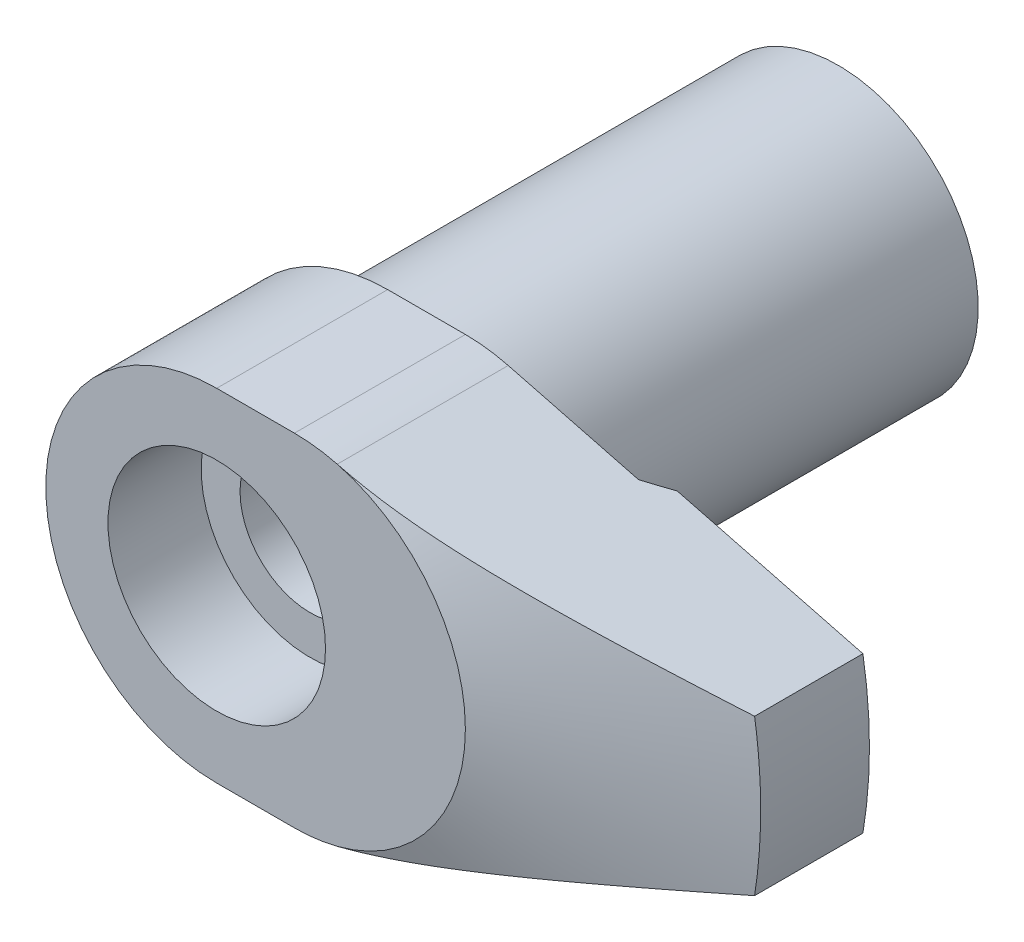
ISO-10303-21;
HEADER;
FILE_DESCRIPTION(('STEP AP214'),'2;1');
FILE_NAME('part.step','',(''),(''),'','','');
FILE_SCHEMA(('AUTOMOTIVE_DESIGN { 1 0 10303 214 1 1 1 1 }'));
ENDSEC;
DATA;
#1=APPLICATION_CONTEXT('core data for automotive mechanical design processes');
#2=APPLICATION_PROTOCOL_DEFINITION('international standard','automotive_design',2000,#1);
#3=PRODUCT_CONTEXT('',#1,'mechanical');
#4=PRODUCT('Part','Part','',(#3));
#5=PRODUCT_RELATED_PRODUCT_CATEGORY('part','',(#4));
#6=PRODUCT_DEFINITION_FORMATION('','',#4);
#7=PRODUCT_DEFINITION_CONTEXT('part definition',#1,'design');
#8=PRODUCT_DEFINITION('design','',#6,#7);
#9=PRODUCT_DEFINITION_SHAPE('','',#8);
#10=(LENGTH_UNIT() NAMED_UNIT(*) SI_UNIT(.MILLI.,.METRE.));
#11=(NAMED_UNIT(*) PLANE_ANGLE_UNIT() SI_UNIT($,.RADIAN.));
#12=(NAMED_UNIT(*) SI_UNIT($,.STERADIAN.) SOLID_ANGLE_UNIT());
#13=UNCERTAINTY_MEASURE_WITH_UNIT(LENGTH_MEASURE(1.E-05),#10,'distance_accuracy_value','');
#14=(GEOMETRIC_REPRESENTATION_CONTEXT(3) GLOBAL_UNCERTAINTY_ASSIGNED_CONTEXT((#13)) GLOBAL_UNIT_ASSIGNED_CONTEXT((#10,
#11,#12)) REPRESENTATION_CONTEXT('',''));
#15=CARTESIAN_POINT('',(0.,0.,0.));
#16=DIRECTION('',(0.,0.,1.));
#17=DIRECTION('',(1.,0.,0.));
#18=AXIS2_PLACEMENT_3D('',#15,#16,#17);
#19=CARTESIAN_POINT('',(29.5803989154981,-5.,28.));
#20=DIRECTION('',(0.250587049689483,-0.968094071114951,0.));
#21=DIRECTION('',(0.968094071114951,0.250587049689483,0.));
#22=AXIS2_PLACEMENT_3D('',#19,#20,#21);
#23=PLANE('',#22);
#24=DIRECTION('',(0.,0.,1.));
#25=VECTOR('',#24,1.);
#26=CARTESIAN_POINT('',(29.5803989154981,-5.,28.));
#27=LINE('',#26,#25);
#28=CARTESIAN_POINT('',(29.5803989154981,-5.,28.));
#29=VERTEX_POINT('',#28);
#30=CARTESIAN_POINT('',(29.5803989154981,-5.,34.9700786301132));
#31=VERTEX_POINT('',#30);
#32=EDGE_CURVE('E141',#29,#31,#27,.T.);
#33=ORIENTED_EDGE('',*,*,#32,.T.);
#34=CARTESIAN_POINT('',(29.5805989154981,-4.99994823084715,34.9700123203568));
#35=CARTESIAN_POINT('',(29.1357626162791,-5.11509222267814,35.1174860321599));
#36=CARTESIAN_POINT('',(28.6906869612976,-5.23029817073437,35.2641938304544));
#37=CARTESIAN_POINT('',(27.7999660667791,-5.46085750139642,35.5557686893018));
#38=CARTESIAN_POINT('',(27.3543208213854,-5.57621088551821,35.7006357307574));
#39=CARTESIAN_POINT('',(26.4624675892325,-5.80706331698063,35.9881885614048));
#40=CARTESIAN_POINT('',(26.0162597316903,-5.92256233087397,36.1308747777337));
#41=CARTESIAN_POINT('',(25.1230866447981,-6.15375640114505,36.4136944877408));
#42=CARTESIAN_POINT('',(24.6761214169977,-6.26945145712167,36.5538279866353));
#43=CARTESIAN_POINT('',(23.7834718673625,-6.50051001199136,36.8303799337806));
#44=CARTESIAN_POINT('',(23.3377918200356,-6.61587240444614,36.9668130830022));
#45=CARTESIAN_POINT('',(22.4454084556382,-6.84686205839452,37.2360589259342));
#46=CARTESIAN_POINT('',(21.9987051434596,-6.96248931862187,37.3688716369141));
#47=CARTESIAN_POINT('',(21.103931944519,-7.19409757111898,37.6301684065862));
#48=CARTESIAN_POINT('',(20.6558616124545,-7.31007867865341,37.7586508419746));
#49=CARTESIAN_POINT('',(19.7583140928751,-7.54240505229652,38.0102832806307));
#50=CARTESIAN_POINT('',(19.3088369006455,-7.65875031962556,38.1334332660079));
#51=CARTESIAN_POINT('',(18.4054157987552,-7.89259704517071,38.3739579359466));
#52=CARTESIAN_POINT('',(17.9514615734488,-8.01010117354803,38.4912914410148));
#53=CARTESIAN_POINT('',(17.0416464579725,-8.24560296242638,38.7178219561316));
#54=CARTESIAN_POINT('',(16.5857855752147,-8.36360062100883,38.8270189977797));
#55=CARTESIAN_POINT('',(15.672322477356,-8.60004667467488,39.0352992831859));
#56=CARTESIAN_POINT('',(15.2147222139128,-8.71849456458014,39.1343915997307));
#57=CARTESIAN_POINT('',(14.297156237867,-8.95600263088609,39.3203168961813));
#58=CARTESIAN_POINT('',(13.8371904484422,-9.07506282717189,39.4071494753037));
#59=CARTESIAN_POINT('',(12.9125012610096,-9.31441470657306,39.5663560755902));
#60=CARTESIAN_POINT('',(12.4477655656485,-9.43470957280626,39.638654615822));
#61=CARTESIAN_POINT('',(11.5160403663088,-9.6758826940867,39.7654169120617));
#62=CARTESIAN_POINT('',(11.0490512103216,-9.79676085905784,39.8198833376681));
#63=CARTESIAN_POINT('',(10.3464754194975,-9.97861962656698,39.8863416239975));
#64=CARTESIAN_POINT('',(10.111552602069,-10.0394284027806,39.9059735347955));
#65=CARTESIAN_POINT('',(9.64134067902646,-10.1611407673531,39.939841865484));
#66=CARTESIAN_POINT('',(9.40605157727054,-10.2220443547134,39.9540783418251));
#67=CARTESIAN_POINT('',(8.93508346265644,-10.3439524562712,39.9769487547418));
#68=CARTESIAN_POINT('',(8.69940430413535,-10.4049570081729,39.9855794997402));
#69=CARTESIAN_POINT('',(8.22790353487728,-10.5270029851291,39.9971137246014));
#70=CARTESIAN_POINT('',(7.99208191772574,-10.5880444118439,40.0000169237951));
#71=CARTESIAN_POINT('',(7.75625754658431,-10.6490865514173,39.9999999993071));
#72=B_SPLINE_CURVE_WITH_KNOTS('',3,(#34,#35,#36,#37,#38,#39,#40,#41,#42,#43,#44,#45,#46,#47,#48,
#49,#50,#51,#52,#53,#54,#55,#56,#57,#58,#59,#60,#61,#62,#63,#64,#65,#66,#67,#68,#69,#70,#71),
.UNSPECIFIED.,.F.,.F.,(4,2,2,2,2,2,2,2,2,2,2,2,2,2,2,2,2,2,4),(0.,1.44774916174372,
2.89551333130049,4.34299021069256,5.79046413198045,7.23093053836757,8.67139007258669,
10.1123837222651,11.5533822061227,13.0034407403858,14.4534936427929,15.9022328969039,
17.3510195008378,18.8071461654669,20.2630547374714,20.9933787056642,21.7236950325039,
22.4544267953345,23.1851943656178),.UNSPECIFIED.);
#73=CARTESIAN_POINT('',(7.75645754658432,-10.6490347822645,40.));
#74=VERTEX_POINT('',#73);
#75=EDGE_CURVE('E36',#31,#74,#72,.T.);
#76=ORIENTED_EDGE('',*,*,#75,.T.);
#77=DIRECTION('',(0.,0.,1.));
#78=VECTOR('',#77,1.);
#79=CARTESIAN_POINT('',(7.75645754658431,-10.6490347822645,28.));
#80=LINE('',#79,#78);
#81=CARTESIAN_POINT('',(7.75645754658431,-10.6490347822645,29.));
#82=VERTEX_POINT('',#81);
#83=EDGE_CURVE('E145',#82,#74,#80,.T.);
#84=ORIENTED_EDGE('',*,*,#83,.F.);
#85=DIRECTION('',(-0.968094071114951,-0.250587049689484,0.));
#86=VECTOR('',#85,1.);
#87=CARTESIAN_POINT('',(16.1403981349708,-8.47888727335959,29.));
#88=LINE('',#87,#86);
#89=CARTESIAN_POINT('',(16.1403981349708,-8.47888727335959,29.));
#90=VERTEX_POINT('',#89);
#91=EDGE_CURVE('E219',#90,#82,#88,.T.);
#92=ORIENTED_EDGE('',*,*,#91,.F.);
#93=CARTESIAN_POINT('',(-0.356308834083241,-12.7489899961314,29.171522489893));
#94=CARTESIAN_POINT('',(-0.159761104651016,-12.6981144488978,29.2945403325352));
#95=CARTESIAN_POINT('',(0.0379983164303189,-12.6469252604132,29.4155205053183));
#96=CARTESIAN_POINT('',(0.436199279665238,-12.5438526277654,29.6527843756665));
#97=CARTESIAN_POINT('',(0.636641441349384,-12.4919690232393,29.7690669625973));
#98=CARTESIAN_POINT('',(1.04115426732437,-12.3872625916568,29.9966949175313));
#99=CARTESIAN_POINT('',(1.24523595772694,-12.3344369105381,30.1080194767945));
#100=CARTESIAN_POINT('',(1.65644867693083,-12.2279962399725,30.3244385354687));
#101=CARTESIAN_POINT('',(1.86357952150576,-12.1743812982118,30.4295334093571));
#102=CARTESIAN_POINT('',(2.49827963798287,-12.010091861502,30.7382708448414));
#103=CARTESIAN_POINT('',(2.93106166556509,-11.8980680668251,30.9307264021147));
#104=CARTESIAN_POINT('',(3.81057680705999,-11.6704092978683,31.2766267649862));
#105=CARTESIAN_POINT('',(4.25728771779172,-11.5547800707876,31.4301304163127));
#106=CARTESIAN_POINT('',(5.02089611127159,-11.3571232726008,31.6470390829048));
#107=CARTESIAN_POINT('',(5.33428496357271,-11.2760038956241,31.7235904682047));
#108=CARTESIAN_POINT('',(5.96612529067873,-11.1124547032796,31.8502162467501));
#109=CARTESIAN_POINT('',(6.28457678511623,-11.03002488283,31.9002905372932));
#110=CARTESIAN_POINT('',(6.92169076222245,-10.8651106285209,31.9710605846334));
#111=CARTESIAN_POINT('',(7.24032600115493,-10.7826332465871,31.9920145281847));
#112=CARTESIAN_POINT('',(7.87812931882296,-10.6175405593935,32.0042125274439));
#113=CARTESIAN_POINT('',(8.1972973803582,-10.5349252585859,31.9954575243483));
#114=CARTESIAN_POINT('',(8.83369537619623,-10.3701963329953,31.9487276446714));
#115=CARTESIAN_POINT('',(9.15092463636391,-10.2880828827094,31.9107431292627));
#116=CARTESIAN_POINT('',(9.78117559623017,-10.1249450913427,31.8075575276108));
#117=CARTESIAN_POINT('',(10.0941968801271,-10.0439208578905,31.7423537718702));
#118=CARTESIAN_POINT('',(10.7160969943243,-9.88294464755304,31.5873480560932));
#119=CARTESIAN_POINT('',(11.0249465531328,-9.8030002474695,31.4974223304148));
#120=CARTESIAN_POINT('',(11.6360813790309,-9.64481058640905,31.2965660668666));
#121=CARTESIAN_POINT('',(11.9383669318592,-9.56656525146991,31.185636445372));
#122=CARTESIAN_POINT('',(12.6350607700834,-9.38622900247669,30.9065344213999));
#123=CARTESIAN_POINT('',(13.026903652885,-9.28480213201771,30.7315591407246));
#124=CARTESIAN_POINT('',(13.7995718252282,-9.08480024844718,30.3571468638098));
#125=CARTESIAN_POINT('',(14.1803909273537,-8.98622683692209,30.1576964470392));
#126=CARTESIAN_POINT('',(14.9328451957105,-8.7914572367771,29.739394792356));
#127=CARTESIAN_POINT('',(15.3044597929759,-8.69526637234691,29.520504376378));
#128=CARTESIAN_POINT('',(16.0389739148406,-8.50514050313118,29.0678893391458));
#129=CARTESIAN_POINT('',(16.4018749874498,-8.4112050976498,28.8341673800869));
#130=CARTESIAN_POINT('',(17.1231554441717,-8.22450470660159,28.3530942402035));
#131=CARTESIAN_POINT('',(17.4814762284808,-8.13175488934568,28.1056497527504));
#132=CARTESIAN_POINT('',(18.1917862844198,-7.9478941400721,27.6012566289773));
#133=CARTESIAN_POINT('',(18.5437753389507,-7.85678326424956,27.344307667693));
#134=CARTESIAN_POINT('',(19.241984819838,-7.67605469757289,26.8230436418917));
#135=CARTESIAN_POINT('',(19.5882113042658,-7.58643543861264,26.5587372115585));
#136=CARTESIAN_POINT('',(20.2760952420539,-7.40837959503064,26.0238828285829));
#137=CARTESIAN_POINT('',(20.6177527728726,-7.31994299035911,25.7533349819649));
#138=CARTESIAN_POINT('',(21.5179640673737,-7.08692710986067,25.0296038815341));
#139=CARTESIAN_POINT('',(22.0731795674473,-6.94321192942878,24.5719921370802));
#140=CARTESIAN_POINT('',(23.1755337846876,-6.65787220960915,23.646249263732));
#141=CARTESIAN_POINT('',(23.7226703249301,-6.51624823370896,23.1781153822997));
#142=CARTESIAN_POINT('',(24.8002386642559,-6.23732423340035,22.2427262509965));
#143=CARTESIAN_POINT('',(25.3307912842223,-6.09999293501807,21.7756192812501));
#144=CARTESIAN_POINT('',(26.1227350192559,-5.89500165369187,21.0705230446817));
#145=CARTESIAN_POINT('',(26.3860198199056,-5.82685149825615,20.8347962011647));
#146=CARTESIAN_POINT('',(26.9114454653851,-5.69084729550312,20.3619909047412));
#147=CARTESIAN_POINT('',(27.1735863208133,-5.62299324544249,20.124912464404));
#148=CARTESIAN_POINT('',(27.4352162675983,-5.55527144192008,19.8872336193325));
#149=B_SPLINE_CURVE_WITH_KNOTS('',3,(#93,#94,#95,#96,#97,#98,#99,#100,#101,#102,#103,#104,#105,
#106,#107,#108,#109,#110,#111,#112,#113,#114,#115,#116,#117,#118,#119,#120,#121,#122,#123,#124,
#125,#126,#127,#128,#129,#130,#131,#132,#133,#134,#135,#136,#137,#138,#139,#140,#141,#142,#143,
#144,#145,#146,#147,#148),.UNSPECIFIED.,.F.,.F.,(4,2,2,2,2,2,2,2,2,2,2,2,2,2,2,2,2,2,2,2,2,2,2,
2,2,2,2,4),(0.,0.712170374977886,1.42450815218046,2.13959781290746,2.85464444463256,
4.31337521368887,5.76988893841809,6.76688167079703,7.76387827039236,8.75197765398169,
9.74004573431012,10.7284397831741,11.7169307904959,12.710463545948,13.7039529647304,
15.0257282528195,16.3482315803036,17.6734634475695,18.9984581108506,20.3339498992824,
21.6694873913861,23.0035186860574,24.3375273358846,26.5384684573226,28.7399921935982,
30.9002141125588,31.9799210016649,33.0596178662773),.UNSPECIFIED.);
#150=CARTESIAN_POINT('',(17.6291186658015,-8.09353826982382,28.));
#151=VERTEX_POINT('',#150);
#152=EDGE_CURVE('E196',#90,#151,#149,.T.);
#153=ORIENTED_EDGE('',*,*,#152,.T.);
#154=DIRECTION('',(0.968094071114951,0.250587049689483,0.));
#155=VECTOR('',#154,1.);
#156=CARTESIAN_POINT('',(29.5803989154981,-5.,28.));
#157=LINE('',#156,#155);
#158=EDGE_CURVE('E135',#151,#29,#157,.T.);
#159=ORIENTED_EDGE('',*,*,#158,.T.);
#160=EDGE_LOOP('',(#33,#76,#84,#92,#153,#159));
#161=FACE_BOUND('',#160,.T.);
#162=ADVANCED_FACE('F15',(#161),#23,.T.);
#163=CARTESIAN_POINT('',(29.5803989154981,5.,28.));
#164=DIRECTION('',(0.250587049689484,0.968094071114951,0.));
#165=DIRECTION('',(-0.968094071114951,0.250587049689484,0.));
#166=AXIS2_PLACEMENT_3D('',#163,#164,#165);
#167=PLANE('',#166);
#168=DIRECTION('',(0.,0.,1.));
#169=VECTOR('',#168,1.);
#170=CARTESIAN_POINT('',(7.75645754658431,10.6490347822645,28.));
#171=LINE('',#170,#169);
#172=CARTESIAN_POINT('',(7.75645754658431,10.6490347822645,29.));
#173=VERTEX_POINT('',#172);
#174=CARTESIAN_POINT('',(7.75645754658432,10.6490347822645,40.));
#175=VERTEX_POINT('',#174);
#176=EDGE_CURVE('E115',#173,#175,#171,.T.);
#177=ORIENTED_EDGE('',*,*,#176,.T.);
#178=CARTESIAN_POINT('',(7.75625754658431,10.6490865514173,39.9999999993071));
#179=CARTESIAN_POINT('',(7.98917423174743,10.5887970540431,40.0000161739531));
#180=CARTESIAN_POINT('',(8.22208831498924,10.5285082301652,39.997184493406));
#181=CARTESIAN_POINT('',(8.68777942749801,10.4079660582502,39.985932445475));
#182=CARTESIAN_POINT('',(8.92055646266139,10.3477127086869,39.9775123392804));
#183=CARTESIAN_POINT('',(9.38573625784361,10.2273028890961,39.9551965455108));
#184=CARTESIAN_POINT('',(9.61813915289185,10.1671463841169,39.9413038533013));
#185=CARTESIAN_POINT('',(10.0825912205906,10.0469249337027,39.90824655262));
#186=CARTESIAN_POINT('',(10.3146403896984,9.98685998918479,39.8890818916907));
#187=CARTESIAN_POINT('',(11.0086634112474,9.80721506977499,39.8241869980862));
#188=CARTESIAN_POINT('',(11.4699954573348,9.68780122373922,39.7709816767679));
#189=CARTESIAN_POINT('',(12.3904710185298,9.44954002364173,39.6470760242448));
#190=CARTESIAN_POINT('',(12.8496142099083,9.33069275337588,39.5763731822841));
#191=CARTESIAN_POINT('',(13.7632169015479,9.09421056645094,39.4205799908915));
#192=CARTESIAN_POINT('',(14.2176883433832,8.97657255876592,39.3355636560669));
#193=CARTESIAN_POINT('',(15.1243152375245,8.74189602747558,39.1534202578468));
#194=CARTESIAN_POINT('',(15.5764707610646,8.6248574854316,39.0562935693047));
#195=CARTESIAN_POINT('',(16.4790686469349,8.39122384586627,38.8520399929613));
#196=CARTESIAN_POINT('',(16.9295091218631,8.27462923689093,38.7449042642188));
#197=CARTESIAN_POINT('',(17.8285084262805,8.04192707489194,38.522549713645));
#198=CARTESIAN_POINT('',(18.2770672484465,7.92581952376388,38.4073308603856));
#199=CARTESIAN_POINT('',(19.1807959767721,7.69189317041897,38.1681266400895));
#200=CARTESIAN_POINT('',(19.6359353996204,7.57408225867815,38.0440188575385));
#201=CARTESIAN_POINT('',(20.544753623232,7.33883851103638,37.7902440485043));
#202=CARTESIAN_POINT('',(20.9984324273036,7.22140567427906,37.6605770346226));
#203=CARTESIAN_POINT('',(21.9043813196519,6.98690464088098,37.3967370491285));
#204=CARTESIAN_POINT('',(22.3566518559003,6.86983632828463,37.2625657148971));
#205=CARTESIAN_POINT('',(23.2601341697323,6.63597375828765,36.9904700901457));
#206=CARTESIAN_POINT('',(23.7113459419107,6.51917950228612,36.8525457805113));
#207=CARTESIAN_POINT('',(24.6151130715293,6.28524320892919,36.5728846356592));
#208=CARTESIAN_POINT('',(25.067663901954,6.16810234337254,36.4311322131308));
#209=CARTESIAN_POINT('',(25.9719849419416,5.93402267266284,36.1449941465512));
#210=CARTESIAN_POINT('',(26.4237551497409,5.81708386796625,36.00060849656));
#211=CARTESIAN_POINT('',(27.3267044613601,5.58335926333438,35.7095973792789));
#212=CARTESIAN_POINT('',(27.7778834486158,5.46657349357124,35.562971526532));
#213=CARTESIAN_POINT('',(28.67965632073,5.2331534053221,35.2678293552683));
#214=CARTESIAN_POINT('',(29.1302502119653,5.1165190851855,35.1193130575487));
#215=CARTESIAN_POINT('',(29.5805989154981,4.99994823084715,34.9700123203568));
#216=B_SPLINE_CURVE_WITH_KNOTS('',3,(#178,#179,#180,#181,#182,#183,#184,#185,#186,#187,#188,
#189,#190,#191,#192,#193,#194,#195,#196,#197,#198,#199,#200,#201,#202,#203,#204,#205,#206,#207,
#208,#209,#210,#211,#212,#213,#214,#215),.UNSPECIFIED.,.F.,.F.,(4,2,2,2,2,2,2,2,2,2,2,2,2,2,2,2,
2,2,4),(0.,0.721757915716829,1.44348210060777,2.16481180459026,2.88614868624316,
4.32422625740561,5.76251030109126,7.19357343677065,8.62459228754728,10.0568873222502,
11.4891879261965,12.9478809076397,14.4065705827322,15.864735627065,17.3229080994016,
18.788355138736,20.2538054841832,21.7195108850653,23.1852001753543),.UNSPECIFIED.);
#217=CARTESIAN_POINT('',(29.5803989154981,5.,34.9700786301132));
#218=VERTEX_POINT('',#217);
#219=EDGE_CURVE('E95',#175,#218,#216,.T.);
#220=ORIENTED_EDGE('',*,*,#219,.T.);
#221=DIRECTION('',(0.,0.,1.));
#222=VECTOR('',#221,1.);
#223=CARTESIAN_POINT('',(29.5803989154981,5.,28.));
#224=LINE('',#223,#222);
#225=CARTESIAN_POINT('',(29.5803989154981,5.,28.));
#226=VERTEX_POINT('',#225);
#227=EDGE_CURVE('E121',#226,#218,#224,.T.);
#228=ORIENTED_EDGE('',*,*,#227,.F.);
#229=DIRECTION('',(-0.968094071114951,0.250587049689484,0.));
#230=VECTOR('',#229,1.);
#231=CARTESIAN_POINT('',(29.5803989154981,5.,28.));
#232=LINE('',#231,#230);
#233=CARTESIAN_POINT('',(17.6291186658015,8.09353826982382,28.));
#234=VERTEX_POINT('',#233);
#235=EDGE_CURVE('E448',#226,#234,#232,.T.);
#236=ORIENTED_EDGE('',*,*,#235,.T.);
#237=CARTESIAN_POINT('',(27.4352162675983,5.55527144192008,19.8872336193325));
#238=CARTESIAN_POINT('',(27.1469393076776,5.6298907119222,20.1491153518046));
#239=CARTESIAN_POINT('',(26.8580444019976,5.70466993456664,20.4102731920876));
#240=CARTESIAN_POINT('',(26.2788498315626,5.85459199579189,20.9309294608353));
#241=CARTESIAN_POINT('',(25.988550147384,5.92973483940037,21.1904278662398));
#242=CARTESIAN_POINT('',(25.40625994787,6.08045819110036,21.7076575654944));
#243=CARTESIAN_POINT('',(25.1142687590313,6.15603887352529,21.9653880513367));
#244=CARTESIAN_POINT('',(24.5285196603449,6.30765754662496,22.4786929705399));
#245=CARTESIAN_POINT('',(24.234761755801,6.38369553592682,22.734267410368));
#246=CARTESIAN_POINT('',(23.3389665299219,6.61556833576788,23.5072735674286));
#247=CARTESIAN_POINT('',(22.7337827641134,6.77221759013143,24.0208431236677));
#248=CARTESIAN_POINT('',(21.8180133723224,7.00926061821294,24.7807704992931));
#249=CARTESIAN_POINT('',(21.5114579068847,7.08861120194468,25.0323153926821));
#250=CARTESIAN_POINT('',(20.8952465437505,7.24811490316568,25.5313161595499));
#251=CARTESIAN_POINT('',(20.5855907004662,7.32826800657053,25.7787721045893));
#252=CARTESIAN_POINT('',(19.9624238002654,7.4895721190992,26.2690618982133));
#253=CARTESIAN_POINT('',(19.6489095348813,7.57072395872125,26.5118914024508));
#254=CARTESIAN_POINT('',(19.0177283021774,7.73410254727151,26.9917420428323));
#255=CARTESIAN_POINT('',(18.7000612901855,7.81632930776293,27.2287631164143));
#256=CARTESIAN_POINT('',(18.059644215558,7.98209855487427,27.695970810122));
#257=CARTESIAN_POINT('',(17.7368901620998,8.06564207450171,27.9261516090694));
#258=CARTESIAN_POINT('',(17.0857762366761,8.23418015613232,28.3779063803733));
#259=CARTESIAN_POINT('',(16.7574164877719,8.31917468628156,28.5994805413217));
#260=CARTESIAN_POINT('',(16.0961063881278,8.4903520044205,29.0307522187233));
#261=CARTESIAN_POINT('',(15.7631938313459,8.57652500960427,29.2405113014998));
#262=CARTESIAN_POINT('',(15.0898925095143,8.75080620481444,29.6469894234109));
#263=CARTESIAN_POINT('',(14.7495028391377,8.83891462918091,29.8437068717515));
#264=CARTESIAN_POINT('',(14.0607320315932,9.01720003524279,30.2204922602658));
#265=CARTESIAN_POINT('',(13.7123625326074,9.10737400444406,30.4005827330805));
#266=CARTESIAN_POINT('',(13.0063877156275,9.29011259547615,30.7401308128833));
#267=CARTESIAN_POINT('',(12.6487859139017,9.38267630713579,30.8995961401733));
#268=CARTESIAN_POINT('',(11.9176536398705,9.57192679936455,31.1952138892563));
#269=CARTESIAN_POINT('',(11.5439568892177,9.66865662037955,31.3309325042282));
#270=CARTESIAN_POINT('',(10.7866333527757,9.86468660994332,31.5693931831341));
#271=CARTESIAN_POINT('',(10.4030079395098,9.96398642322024,31.6721397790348));
#272=CARTESIAN_POINT('',(9.82318396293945,10.1140714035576,31.7964437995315));
#273=CARTESIAN_POINT('',(9.62990718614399,10.1641002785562,31.832828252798));
#274=CARTESIAN_POINT('',(9.24180831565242,10.2645580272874,31.8952742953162));
#275=CARTESIAN_POINT('',(9.04698647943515,10.3149868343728,31.9213375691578));
#276=CARTESIAN_POINT('',(8.65628411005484,10.4161184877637,31.9626251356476));
#277=CARTESIAN_POINT('',(8.46040367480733,10.4668213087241,31.9778504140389));
#278=CARTESIAN_POINT('',(8.06812506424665,10.5683609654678,31.9971505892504));
#279=CARTESIAN_POINT('',(7.87172688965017,10.6191978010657,32.001225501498));
#280=CARTESIAN_POINT('',(7.47834221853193,10.7210237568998,31.9981314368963));
#281=CARTESIAN_POINT('',(7.28135600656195,10.772012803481,31.9909239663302));
#282=CARTESIAN_POINT('',(6.88806770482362,10.8738138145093,31.9653489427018));
#283=CARTESIAN_POINT('',(6.69176561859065,10.9246257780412,31.9469813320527));
#284=CARTESIAN_POINT('',(6.30036520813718,11.0259381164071,31.8994613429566));
#285=CARTESIAN_POINT('',(6.10526705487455,11.0764384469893,31.8703074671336));
#286=CARTESIAN_POINT('',(5.71674773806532,11.177005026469,31.8017843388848));
#287=CARTESIAN_POINT('',(5.52332685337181,11.2270712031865,31.7624134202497));
#288=CARTESIAN_POINT('',(4.94179129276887,11.3775992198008,31.6289953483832));
#289=CARTESIAN_POINT('',(4.55679436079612,11.4772540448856,31.5202003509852));
#290=CARTESIAN_POINT('',(3.79703012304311,11.6739157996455,31.2701775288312));
#291=CARTESIAN_POINT('',(3.42226333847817,11.7709225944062,31.1289480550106));
#292=CARTESIAN_POINT('',(2.75325179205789,11.9440933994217,30.8497227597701));
#293=CARTESIAN_POINT('',(2.45723011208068,12.0207173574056,30.7162053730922));
#294=CARTESIAN_POINT('',(1.87162827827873,12.1722979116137,30.4349750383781));
#295=CARTESIAN_POINT('',(1.58204774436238,12.247254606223,30.2872629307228));
#296=CARTESIAN_POINT('',(1.01474960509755,12.3940973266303,29.9833062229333));
#297=CARTESIAN_POINT('',(0.736910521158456,12.466014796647,29.8273017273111));
#298=CARTESIAN_POINT('',(0.186515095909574,12.6084823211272,29.5059660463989));
#299=CARTESIAN_POINT('',(-0.0860439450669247,12.679033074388,29.3406398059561));
#300=CARTESIAN_POINT('',(-0.356308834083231,12.7489899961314,29.171522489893));
#301=B_SPLINE_CURVE_WITH_KNOTS('',3,(#237,#238,#239,#240,#241,#242,#243,#244,#245,#246,#247,
#248,#249,#250,#251,#252,#253,#254,#255,#256,#257,#258,#259,#260,#261,#262,#263,#264,#265,#266,
#267,#268,#269,#270,#271,#272,#273,#274,#275,#276,#277,#278,#279,#280,#281,#282,#283,#284,#285,
#286,#287,#288,#289,#290,#291,#292,#293,#294,#295,#296,#297,#298,#299,#300),.UNSPECIFIED.,.F.,
.F.,(4,2,2,2,2,2,2,2,2,2,2,2,2,2,2,2,2,2,2,2,2,2,2,2,2,2,2,2,2,2,2,4),(0.,1.1896572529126,
2.37933100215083,3.56951641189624,4.75969825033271,7.18662885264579,8.39983408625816,
9.61301806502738,10.8272900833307,12.0415751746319,13.2568656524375,14.4721294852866,
15.6803270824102,16.8886717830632,18.0953541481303,19.3015835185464,20.5279572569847,
21.7541623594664,22.3627422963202,22.9712228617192,23.5796480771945,24.1880724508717,
24.798577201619,25.4090851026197,26.0196777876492,26.6303701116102,27.8654022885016,
29.1004972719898,30.1010602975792,31.1015641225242,32.0813446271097,33.0606101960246),.UNSPECIFIED.);
#302=CARTESIAN_POINT('',(16.1403981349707,8.4788872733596,29.));
#303=VERTEX_POINT('',#302);
#304=EDGE_CURVE('E29',#234,#303,#301,.T.);
#305=ORIENTED_EDGE('',*,*,#304,.T.);
#306=DIRECTION('',(0.968094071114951,-0.250587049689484,0.));
#307=VECTOR('',#306,1.);
#308=CARTESIAN_POINT('',(7.75645754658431,10.6490347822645,29.));
#309=LINE('',#308,#307);
#310=EDGE_CURVE('E43',#173,#303,#309,.T.);
#311=ORIENTED_EDGE('',*,*,#310,.F.);
#312=EDGE_LOOP('',(#177,#220,#228,#236,#305,#311));
#313=FACE_BOUND('',#312,.T.);
#314=ADVANCED_FACE('F116',(#313),#167,.T.);
#315=CARTESIAN_POINT('',(0.,0.,40.));
#316=DIRECTION('',(0.,0.,1.));
#317=DIRECTION('',(1.,0.,0.));
#318=AXIS2_PLACEMENT_3D('',#315,#316,#317);
#319=PLANE('',#318);
#320=CARTESIAN_POINT('',(0.,0.,40.));
#321=DIRECTION('',(0.,0.,1.));
#322=DIRECTION('',(1.,0.,0.));
#323=AXIS2_PLACEMENT_3D('',#320,#321,#322);
#324=CIRCLE('',#323,7.);
#325=CARTESIAN_POINT('',(7.,0.,40.));
#326=VERTEX_POINT('',#325);
#327=EDGE_CURVE('E144',#326,#326,#324,.T.);
#328=ORIENTED_EDGE('',*,*,#327,.F.);
#329=EDGE_LOOP('',(#328));
#330=FACE_BOUND('',#329,.T.);
#331=CARTESIAN_POINT('',(5.,0.,40.));
#332=DIRECTION('',(0.,0.,1.));
#333=DIRECTION('',(1.,0.,0.));
#334=AXIS2_PLACEMENT_3D('',#331,#332,#333);
#335=CIRCLE('',#334,11.);
#336=CARTESIAN_POINT('',(5.,-11.,40.));
#337=VERTEX_POINT('',#336);
#338=EDGE_CURVE('E112',#337,#74,#335,.T.);
#339=ORIENTED_EDGE('',*,*,#338,.T.);
#340=CARTESIAN_POINT('',(5.,0.,40.));
#341=DIRECTION('',(0.,0.,-1.));
#342=DIRECTION('',(-1.,0.,0.));
#343=AXIS2_PLACEMENT_3D('',#340,#341,#342);
#344=CIRCLE('',#343,11.);
#345=EDGE_CURVE('E98',#175,#74,#344,.T.);
#346=ORIENTED_EDGE('',*,*,#345,.F.);
#347=CARTESIAN_POINT('',(5.,0.,40.));
#348=DIRECTION('',(0.,0.,1.));
#349=DIRECTION('',(1.,0.,0.));
#350=AXIS2_PLACEMENT_3D('',#347,#348,#349);
#351=CIRCLE('',#350,11.);
#352=CARTESIAN_POINT('',(5.,11.,40.));
#353=VERTEX_POINT('',#352);
#354=EDGE_CURVE('E109',#175,#353,#351,.T.);
#355=ORIENTED_EDGE('',*,*,#354,.T.);
#356=DIRECTION('',(-1.,0.,0.));
#357=VECTOR('',#356,1.);
#358=CARTESIAN_POINT('',(5.,11.,40.));
#359=LINE('',#358,#357);
#360=CARTESIAN_POINT('',(0.,11.,40.));
#361=VERTEX_POINT('',#360);
#362=EDGE_CURVE('E126',#353,#361,#359,.T.);
#363=ORIENTED_EDGE('',*,*,#362,.T.);
#364=CARTESIAN_POINT('',(0.,0.,40.));
#365=DIRECTION('',(0.,0.,1.));
#366=DIRECTION('',(1.,0.,0.));
#367=AXIS2_PLACEMENT_3D('',#364,#365,#366);
#368=CIRCLE('',#367,11.);
#369=CARTESIAN_POINT('',(1.1521895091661E-13,-11.,40.));
#370=VERTEX_POINT('',#369);
#371=EDGE_CURVE('E174',#361,#370,#368,.T.);
#372=ORIENTED_EDGE('',*,*,#371,.T.);
#373=DIRECTION('',(1.,0.,0.));
#374=VECTOR('',#373,1.);
#375=CARTESIAN_POINT('',(5.,-11.,40.));
#376=LINE('',#375,#374);
#377=EDGE_CURVE('E129',#370,#337,#376,.T.);
#378=ORIENTED_EDGE('',*,*,#377,.T.);
#379=EDGE_LOOP('',(#339,#346,#355,#363,#372,#378));
#380=FACE_BOUND('',#379,.T.);
#381=ADVANCED_FACE('F106',(#330,#380),#319,.T.);
#382=CARTESIAN_POINT('',(0.,0.,28.));
#383=DIRECTION('',(0.,0.,1.));
#384=DIRECTION('',(1.,0.,0.));
#385=AXIS2_PLACEMENT_3D('',#382,#383,#384);
#386=CYLINDRICAL_SURFACE('',#385,30.);
#387=ORIENTED_EDGE('',*,*,#227,.T.);
#388=CARTESIAN_POINT('',(29.5803651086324,5.0002,34.9700762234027));
#389=CARTESIAN_POINT('',(29.650388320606,4.58595813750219,34.9750613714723));
#390=CARTESIAN_POINT('',(29.7117012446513,4.17028298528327,34.9794301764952));
#391=CARTESIAN_POINT('',(29.8168210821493,3.33671572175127,34.9869245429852));
#392=CARTESIAN_POINT('',(29.86062807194,2.91882362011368,34.9900501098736));
#393=CARTESIAN_POINT('',(29.9651578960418,1.66882854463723,34.9975101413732));
#394=CARTESIAN_POINT('',(30.,0.834414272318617,35.));
#395=CARTESIAN_POINT('',(30.,-0.834414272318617,35.));
#396=CARTESIAN_POINT('',(29.9651578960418,-1.66882854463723,34.9975101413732));
#397=CARTESIAN_POINT('',(29.86062807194,-2.91882362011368,34.9900501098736));
#398=CARTESIAN_POINT('',(29.8168210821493,-3.33671572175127,34.9869245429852));
#399=CARTESIAN_POINT('',(29.7117012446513,-4.17028298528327,34.9794301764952));
#400=CARTESIAN_POINT('',(29.650388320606,-4.58595813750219,34.9750613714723));
#401=CARTESIAN_POINT('',(29.5803651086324,-5.0002,34.9700762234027));
#402=B_SPLINE_CURVE_WITH_KNOTS('',3,(#388,#389,#390,#391,#392,#393,#394,#395,#396,#397,#398,
#399,#400,#401),.UNSPECIFIED.,.F.,.F.,(4,2,2,2,2,2,4),(0.,1.2602595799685,2.52051366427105,
5.02284793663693,7.52518220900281,8.78543629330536,10.0456958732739),.UNSPECIFIED.);
#403=EDGE_CURVE('E9',#218,#31,#402,.T.);
#404=ORIENTED_EDGE('',*,*,#403,.T.);
#405=ORIENTED_EDGE('',*,*,#32,.F.);
#406=CARTESIAN_POINT('',(0.,0.,28.));
#407=DIRECTION('',(0.,0.,1.));
#408=DIRECTION('',(1.,0.,0.));
#409=AXIS2_PLACEMENT_3D('',#406,#407,#408);
#410=CIRCLE('',#409,30.);
#411=EDGE_CURVE('E140',#29,#226,#410,.T.);
#412=ORIENTED_EDGE('',*,*,#411,.T.);
#413=EDGE_LOOP('',(#387,#404,#405,#412));
#414=FACE_BOUND('',#413,.T.);
#415=ADVANCED_FACE('F267',(#414),#386,.T.);
#416=CARTESIAN_POINT('',(5.,0.,28.));
#417=DIRECTION('',(0.,0.,1.));
#418=DIRECTION('',(1.,0.,0.));
#419=AXIS2_PLACEMENT_3D('',#416,#417,#418);
#420=CYLINDRICAL_SURFACE('',#419,11.);
#421=DIRECTION('',(0.,0.,1.));
#422=VECTOR('',#421,1.);
#423=CARTESIAN_POINT('',(5.,-11.,28.));
#424=LINE('',#423,#422);
#425=CARTESIAN_POINT('',(5.,-11.,29.));
#426=VERTEX_POINT('',#425);
#427=EDGE_CURVE('E148',#426,#337,#424,.T.);
#428=ORIENTED_EDGE('',*,*,#427,.F.);
#429=CARTESIAN_POINT('',(5.,0.,29.));
#430=DIRECTION('',(0.,0.,-1.));
#431=DIRECTION('',(-1.,0.,0.));
#432=AXIS2_PLACEMENT_3D('',#429,#430,#431);
#433=CIRCLE('',#432,11.);
#434=EDGE_CURVE('E225',#82,#426,#433,.T.);
#435=ORIENTED_EDGE('',*,*,#434,.F.);
#436=ORIENTED_EDGE('',*,*,#83,.T.);
#437=ORIENTED_EDGE('',*,*,#338,.F.);
#438=EDGE_LOOP('',(#428,#435,#436,#437));
#439=FACE_BOUND('',#438,.T.);
#440=ADVANCED_FACE('F210',(#439),#420,.T.);
#441=CARTESIAN_POINT('',(5.,-11.,28.));
#442=DIRECTION('',(0.,-1.,0.));
#443=DIRECTION('',(1.,0.,0.));
#444=AXIS2_PLACEMENT_3D('',#441,#442,#443);
#445=PLANE('',#444);
#446=DIRECTION('',(0.,0.,1.));
#447=VECTOR('',#446,1.);
#448=CARTESIAN_POINT('',(1.1521895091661E-13,-11.,28.));
#449=LINE('',#448,#447);
#450=CARTESIAN_POINT('',(0.,-11.,29.));
#451=VERTEX_POINT('',#450);
#452=EDGE_CURVE('E150',#451,#370,#449,.T.);
#453=ORIENTED_EDGE('',*,*,#452,.F.);
#454=DIRECTION('',(-1.,0.,0.));
#455=VECTOR('',#454,1.);
#456=CARTESIAN_POINT('',(5.,-11.,29.));
#457=LINE('',#456,#455);
#458=EDGE_CURVE('E227',#426,#451,#457,.T.);
#459=ORIENTED_EDGE('',*,*,#458,.F.);
#460=ORIENTED_EDGE('',*,*,#427,.T.);
#461=ORIENTED_EDGE('',*,*,#377,.F.);
#462=EDGE_LOOP('',(#453,#459,#460,#461));
#463=FACE_BOUND('',#462,.T.);
#464=ADVANCED_FACE('F247',(#463),#445,.T.);
#465=CARTESIAN_POINT('',(5.,11.,28.));
#466=DIRECTION('',(0.,1.,0.));
#467=DIRECTION('',(-1.,0.,0.));
#468=AXIS2_PLACEMENT_3D('',#465,#466,#467);
#469=PLANE('',#468);
#470=DIRECTION('',(0.,0.,1.));
#471=VECTOR('',#470,1.);
#472=CARTESIAN_POINT('',(5.,11.,28.));
#473=LINE('',#472,#471);
#474=CARTESIAN_POINT('',(5.,11.,29.));
#475=VERTEX_POINT('',#474);
#476=EDGE_CURVE('E120',#475,#353,#473,.T.);
#477=ORIENTED_EDGE('',*,*,#476,.F.);
#478=DIRECTION('',(1.,0.,0.));
#479=VECTOR('',#478,1.);
#480=CARTESIAN_POINT('',(0.,11.,29.));
#481=LINE('',#480,#479);
#482=CARTESIAN_POINT('',(0.,11.,29.));
#483=VERTEX_POINT('',#482);
#484=EDGE_CURVE('E229',#483,#475,#481,.T.);
#485=ORIENTED_EDGE('',*,*,#484,.F.);
#486=DIRECTION('',(0.,0.,1.));
#487=VECTOR('',#486,1.);
#488=CARTESIAN_POINT('',(0.,11.,28.));
#489=LINE('',#488,#487);
#490=EDGE_CURVE('E152',#483,#361,#489,.T.);
#491=ORIENTED_EDGE('',*,*,#490,.T.);
#492=ORIENTED_EDGE('',*,*,#362,.F.);
#493=EDGE_LOOP('',(#477,#485,#491,#492));
#494=FACE_BOUND('',#493,.T.);
#495=ADVANCED_FACE('F253',(#494),#469,.T.);
#496=CARTESIAN_POINT('',(5.,0.,28.));
#497=DIRECTION('',(0.,0.,1.));
#498=DIRECTION('',(1.,0.,0.));
#499=AXIS2_PLACEMENT_3D('',#496,#497,#498);
#500=CYLINDRICAL_SURFACE('',#499,11.);
#501=ORIENTED_EDGE('',*,*,#176,.F.);
#502=CARTESIAN_POINT('',(5.,0.,29.));
#503=DIRECTION('',(0.,0.,-1.));
#504=DIRECTION('',(-1.,0.,0.));
#505=AXIS2_PLACEMENT_3D('',#502,#503,#504);
#506=CIRCLE('',#505,11.);
#507=EDGE_CURVE('E231',#475,#173,#506,.T.);
#508=ORIENTED_EDGE('',*,*,#507,.F.);
#509=ORIENTED_EDGE('',*,*,#476,.T.);
#510=ORIENTED_EDGE('',*,*,#354,.F.);
#511=EDGE_LOOP('',(#501,#508,#509,#510));
#512=FACE_BOUND('',#511,.T.);
#513=ADVANCED_FACE('F123',(#512),#500,.T.);
#514=CARTESIAN_POINT('',(30.,20.,28.));
#515=DIRECTION('',(0.,0.,1.));
#516=DIRECTION('',(1.,0.,0.));
#517=AXIS2_PLACEMENT_3D('',#514,#515,#516);
#518=PLANE('',#517);
#519=CARTESIAN_POINT('',(5.,0.,28.));
#520=DIRECTION('',(0.,0.,-1.));
#521=DIRECTION('',(-1.,0.,0.));
#522=AXIS2_PLACEMENT_3D('',#519,#520,#521);
#523=CIRCLE('',#522,15.);
#524=EDGE_CURVE('E233',#234,#151,#523,.T.);
#525=ORIENTED_EDGE('',*,*,#524,.F.);
#526=ORIENTED_EDGE('',*,*,#235,.F.);
#527=ORIENTED_EDGE('',*,*,#411,.F.);
#528=ORIENTED_EDGE('',*,*,#158,.F.);
#529=EDGE_LOOP('',(#525,#526,#527,#528));
#530=FACE_BOUND('',#529,.T.);
#531=ADVANCED_FACE('F262',(#530),#518,.F.);
#532=CARTESIAN_POINT('',(0.,0.,40.));
#533=DIRECTION('',(0.,0.,-1.));
#534=DIRECTION('',(-1.,0.,0.));
#535=AXIS2_PLACEMENT_3D('',#532,#533,#534);
#536=CYLINDRICAL_SURFACE('',#535,11.);
#537=CARTESIAN_POINT('',(0.,0.,29.));
#538=DIRECTION('',(0.,0.,1.));
#539=DIRECTION('',(1.,0.,0.));
#540=AXIS2_PLACEMENT_3D('',#537,#538,#539);
#541=CIRCLE('',#540,11.);
#542=EDGE_CURVE('E132',#483,#451,#541,.T.);
#543=ORIENTED_EDGE('',*,*,#542,.T.);
#544=ORIENTED_EDGE('',*,*,#452,.T.);
#545=ORIENTED_EDGE('',*,*,#371,.F.);
#546=ORIENTED_EDGE('',*,*,#490,.F.);
#547=EDGE_LOOP('',(#543,#544,#545,#546));
#548=FACE_BOUND('',#547,.T.);
#549=ADVANCED_FACE('F17',(#548),#536,.T.);
#550=CARTESIAN_POINT('',(0.,0.,0.));
#551=DIRECTION('',(0.,0.,-1.));
#552=DIRECTION('',(-1.,0.,0.));
#553=AXIS2_PLACEMENT_3D('',#550,#551,#552);
#554=CYLINDRICAL_SURFACE('',#553,4.5);
#555=CARTESIAN_POINT('',(0.,0.,24.));
#556=DIRECTION('',(0.,0.,-1.));
#557=DIRECTION('',(-1.,0.,0.));
#558=AXIS2_PLACEMENT_3D('',#555,#556,#557);
#559=CIRCLE('',#558,4.5);
#560=CARTESIAN_POINT('',(-4.5,0.,24.));
#561=VERTEX_POINT('',#560);
#562=EDGE_CURVE('E168',#561,#561,#559,.T.);
#563=ORIENTED_EDGE('',*,*,#562,.T.);
#564=EDGE_LOOP('',(#563));
#565=FACE_BOUND('',#564,.T.);
#566=CARTESIAN_POINT('',(0.,0.,34.));
#567=DIRECTION('',(0.,0.,1.));
#568=DIRECTION('',(1.,0.,0.));
#569=AXIS2_PLACEMENT_3D('',#566,#567,#568);
#570=CIRCLE('',#569,4.5);
#571=CARTESIAN_POINT('',(4.5,0.,34.));
#572=VERTEX_POINT('',#571);
#573=EDGE_CURVE('E161',#572,#572,#570,.T.);
#574=ORIENTED_EDGE('',*,*,#573,.T.);
#575=EDGE_LOOP('',(#574));
#576=FACE_BOUND('',#575,.T.);
#577=ADVANCED_FACE('F297',(#565,#576),#554,.F.);
#578=CARTESIAN_POINT('',(0.,0.,0.));
#579=DIRECTION('',(0.,0.,1.));
#580=DIRECTION('',(1.,0.,0.));
#581=AXIS2_PLACEMENT_3D('',#578,#579,#580);
#582=PLANE('',#581);
#583=CARTESIAN_POINT('',(0.,0.,0.));
#584=DIRECTION('',(0.,0.,-1.));
#585=DIRECTION('',(-1.,0.,0.));
#586=AXIS2_PLACEMENT_3D('',#583,#584,#585);
#587=CIRCLE('',#586,9.);
#588=CARTESIAN_POINT('',(-9.,0.,0.));
#589=VERTEX_POINT('',#588);
#590=EDGE_CURVE('E171',#589,#589,#587,.T.);
#591=ORIENTED_EDGE('',*,*,#590,.T.);
#592=EDGE_LOOP('',(#591));
#593=FACE_BOUND('',#592,.T.);
#594=CARTESIAN_POINT('',(0.,0.,0.));
#595=DIRECTION('',(0.,0.,-1.));
#596=DIRECTION('',(-1.,0.,0.));
#597=AXIS2_PLACEMENT_3D('',#594,#595,#596);
#598=CIRCLE('',#597,7.);
#599=CARTESIAN_POINT('',(-7.,0.,0.));
#600=VERTEX_POINT('',#599);
#601=EDGE_CURVE('E162',#600,#600,#598,.T.);
#602=ORIENTED_EDGE('',*,*,#601,.F.);
#603=EDGE_LOOP('',(#602));
#604=FACE_BOUND('',#603,.T.);
#605=ADVANCED_FACE('F300',(#593,#604),#582,.F.);
#606=CARTESIAN_POINT('',(0.,0.,28.));
#607=DIRECTION('',(0.,0.,-1.));
#608=DIRECTION('',(-1.,0.,0.));
#609=AXIS2_PLACEMENT_3D('',#606,#607,#608);
#610=CYLINDRICAL_SURFACE('',#609,9.);
#611=ORIENTED_EDGE('',*,*,#590,.F.);
#612=EDGE_LOOP('',(#611));
#613=FACE_BOUND('',#612,.T.);
#614=CARTESIAN_POINT('',(0.,0.,29.));
#615=DIRECTION('',(0.,0.,1.));
#616=DIRECTION('',(1.,0.,0.));
#617=AXIS2_PLACEMENT_3D('',#614,#615,#616);
#618=CIRCLE('',#617,9.);
#619=CARTESIAN_POINT('',(9.,0.,29.));
#620=VERTEX_POINT('',#619);
#621=EDGE_CURVE('E127',#620,#620,#618,.T.);
#622=ORIENTED_EDGE('',*,*,#621,.F.);
#623=EDGE_LOOP('',(#622));
#624=FACE_BOUND('',#623,.T.);
#625=ADVANCED_FACE('F295',(#613,#624),#610,.T.);
#626=CARTESIAN_POINT('',(4.5,0.,24.));
#627=DIRECTION('',(0.,0.,-1.));
#628=DIRECTION('',(-1.,0.,0.));
#629=AXIS2_PLACEMENT_3D('',#626,#627,#628);
#630=PLANE('',#629);
#631=CARTESIAN_POINT('',(0.,0.,24.));
#632=DIRECTION('',(0.,0.,-1.));
#633=DIRECTION('',(-1.,0.,0.));
#634=AXIS2_PLACEMENT_3D('',#631,#632,#633);
#635=CIRCLE('',#634,7.);
#636=CARTESIAN_POINT('',(-7.,0.,24.));
#637=VERTEX_POINT('',#636);
#638=EDGE_CURVE('E165',#637,#637,#635,.T.);
#639=ORIENTED_EDGE('',*,*,#638,.T.);
#640=EDGE_LOOP('',(#639));
#641=FACE_BOUND('',#640,.T.);
#642=ORIENTED_EDGE('',*,*,#562,.F.);
#643=EDGE_LOOP('',(#642));
#644=FACE_BOUND('',#643,.T.);
#645=ADVANCED_FACE('F291',(#641,#644),#630,.T.);
#646=CARTESIAN_POINT('',(0.,0.,0.));
#647=DIRECTION('',(0.,0.,-1.));
#648=DIRECTION('',(-1.,0.,0.));
#649=AXIS2_PLACEMENT_3D('',#646,#647,#648);
#650=CYLINDRICAL_SURFACE('',#649,7.);
#651=ORIENTED_EDGE('',*,*,#601,.T.);
#652=EDGE_LOOP('',(#651));
#653=FACE_BOUND('',#652,.T.);
#654=ORIENTED_EDGE('',*,*,#638,.F.);
#655=EDGE_LOOP('',(#654));
#656=FACE_BOUND('',#655,.T.);
#657=ADVANCED_FACE('F285',(#653,#656),#650,.F.);
#658=CARTESIAN_POINT('',(0.,0.,34.));
#659=DIRECTION('',(0.,0.,1.));
#660=DIRECTION('',(1.,0.,0.));
#661=AXIS2_PLACEMENT_3D('',#658,#659,#660);
#662=CYLINDRICAL_SURFACE('',#661,7.);
#663=CARTESIAN_POINT('',(0.,0.,34.));
#664=DIRECTION('',(0.,0.,1.));
#665=DIRECTION('',(1.,0.,0.));
#666=AXIS2_PLACEMENT_3D('',#663,#664,#665);
#667=CIRCLE('',#666,7.);
#668=CARTESIAN_POINT('',(7.,0.,34.));
#669=VERTEX_POINT('',#668);
#670=EDGE_CURVE('E158',#669,#669,#667,.T.);
#671=ORIENTED_EDGE('',*,*,#670,.F.);
#672=EDGE_LOOP('',(#671));
#673=FACE_BOUND('',#672,.T.);
#674=ORIENTED_EDGE('',*,*,#327,.T.);
#675=EDGE_LOOP('',(#674));
#676=FACE_BOUND('',#675,.T.);
#677=ADVANCED_FACE('F283',(#673,#676),#662,.F.);
#678=CARTESIAN_POINT('',(0.,0.,34.));
#679=DIRECTION('',(0.,0.,1.));
#680=DIRECTION('',(1.,0.,0.));
#681=AXIS2_PLACEMENT_3D('',#678,#679,#680);
#682=PLANE('',#681);
#683=ORIENTED_EDGE('',*,*,#573,.F.);
#684=EDGE_LOOP('',(#683));
#685=FACE_BOUND('',#684,.T.);
#686=ORIENTED_EDGE('',*,*,#670,.T.);
#687=EDGE_LOOP('',(#686));
#688=FACE_BOUND('',#687,.T.);
#689=ADVANCED_FACE('F280',(#685,#688),#682,.T.);
#690=CARTESIAN_POINT('',(-9.,0.,29.));
#691=DIRECTION('',(0.,0.,-1.));
#692=DIRECTION('',(-1.,0.,0.));
#693=AXIS2_PLACEMENT_3D('',#690,#691,#692);
#694=PLANE('',#693);
#695=ORIENTED_EDGE('',*,*,#621,.T.);
#696=EDGE_LOOP('',(#695));
#697=FACE_BOUND('',#696,.T.);
#698=ORIENTED_EDGE('',*,*,#542,.F.);
#699=ORIENTED_EDGE('',*,*,#484,.T.);
#700=ORIENTED_EDGE('',*,*,#507,.T.);
#701=ORIENTED_EDGE('',*,*,#310,.T.);
#702=CARTESIAN_POINT('',(5.,0.,29.));
#703=DIRECTION('',(0.,0.,-1.));
#704=DIRECTION('',(-1.,0.,0.));
#705=AXIS2_PLACEMENT_3D('',#702,#703,#704);
#706=CIRCLE('',#705,14.);
#707=EDGE_CURVE('E204',#303,#90,#706,.T.);
#708=ORIENTED_EDGE('',*,*,#707,.T.);
#709=ORIENTED_EDGE('',*,*,#91,.T.);
#710=ORIENTED_EDGE('',*,*,#434,.T.);
#711=ORIENTED_EDGE('',*,*,#458,.T.);
#712=EDGE_LOOP('',(#698,#699,#700,#701,#708,#709,#710,#711));
#713=FACE_BOUND('',#712,.T.);
#714=ADVANCED_FACE('F190',(#697,#713),#694,.T.);
#715=CARTESIAN_POINT('',(5.,0.,29.));
#716=DIRECTION('',(0.,0.,-1.));
#717=DIRECTION('',(-1.,0.,0.));
#718=AXIS2_PLACEMENT_3D('',#715,#716,#717);
#719=CONICAL_SURFACE('',#718,14.,0.785398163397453);
#720=ORIENTED_EDGE('',*,*,#707,.F.);
#721=ORIENTED_EDGE('',*,*,#304,.F.);
#722=ORIENTED_EDGE('',*,*,#524,.T.);
#723=ORIENTED_EDGE('',*,*,#152,.F.);
#724=EDGE_LOOP('',(#720,#721,#722,#723));
#725=FACE_BOUND('',#724,.T.);
#726=ADVANCED_FACE('F186',(#725),#719,.F.);
#727=CARTESIAN_POINT('',(5.,0.,32.969299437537));
#728=DIRECTION('',(0.,0.,-1.));
#729=DIRECTION('',(-1.,0.,0.));
#730=AXIS2_PLACEMENT_3D('',#727,#728,#729);
#731=CONICAL_SURFACE('',#730,30.6859615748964,1.22777238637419);
#732=ORIENTED_EDGE('',*,*,#403,.F.);
#733=ORIENTED_EDGE('',*,*,#219,.F.);
#734=ORIENTED_EDGE('',*,*,#345,.T.);
#735=ORIENTED_EDGE('',*,*,#75,.F.);
#736=EDGE_LOOP('',(#732,#733,#734,#735));
#737=FACE_BOUND('',#736,.T.);
#738=ADVANCED_FACE('F97',(#737),#731,.T.);
#739=CLOSED_SHELL('',(#162,#314,#381,#415,#440,#464,#495,#513,#531,#549,#577,#605,#625,#645,
#657,#677,#689,#714,#726,#738));
#740=MANIFOLD_SOLID_BREP('B1',#739);
#741=ADVANCED_BREP_SHAPE_REPRESENTATION('',(#18,#740),#14);
#742=SHAPE_DEFINITION_REPRESENTATION(#9,#741);
ENDSEC;
END-ISO-10303-21;
